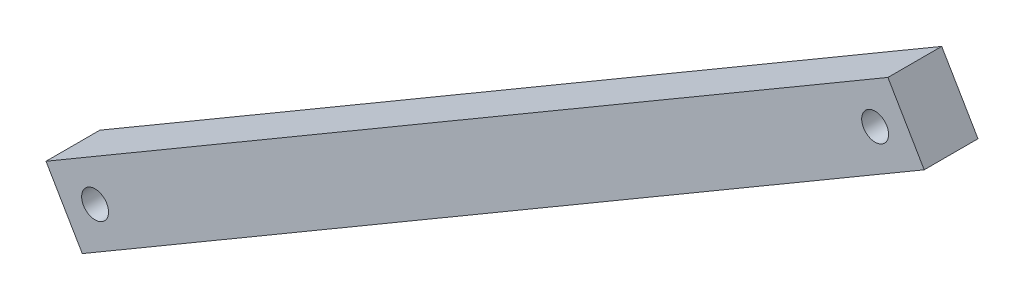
from build123d import *

# Parameters (mm, degrees)
ESQUISSE1_R      = 1.5
EXTRUSION1_DEPTH = 6


with BuildPart() as part:
    # Esquisse1 → Extrusion1 (new body)
    with BuildSketch(Plane.XY):
        Polygon((-5.473669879, 37.427913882), (88.427913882, 92.473669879), (92.473669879, 85.572086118), (-1.427913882, 30.526330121), align=None)
        with Locations((87, 87)):
            Circle(ESQUISSE1_R, mode=Mode.SUBTRACT)
        with Locations((0, 36)):
            Circle(ESQUISSE1_R, mode=Mode.SUBTRACT)
    extrude(amount=EXTRUSION1_DEPTH)


solid = part.part
